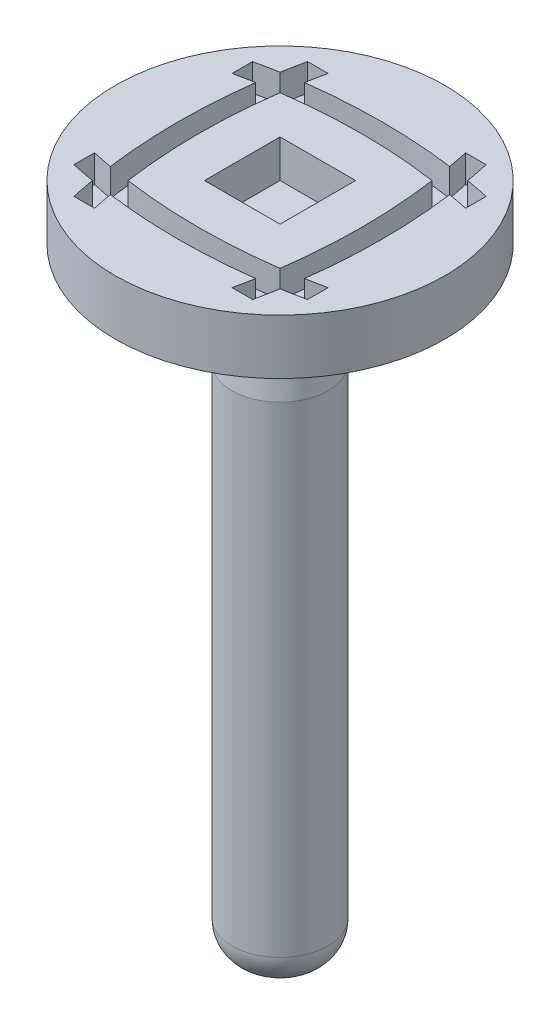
ISO-10303-21;
HEADER;
FILE_DESCRIPTION(('STEP AP214'),'2;1');
FILE_NAME('part.step','',(''),(''),'','','');
FILE_SCHEMA(('AUTOMOTIVE_DESIGN { 1 0 10303 214 1 1 1 1 }'));
ENDSEC;
DATA;
#1=APPLICATION_CONTEXT('core data for automotive mechanical design processes');
#2=APPLICATION_PROTOCOL_DEFINITION('international standard','automotive_design',2000,#1);
#3=PRODUCT_CONTEXT('',#1,'mechanical');
#4=PRODUCT('Part','Part','',(#3));
#5=PRODUCT_RELATED_PRODUCT_CATEGORY('part','',(#4));
#6=PRODUCT_DEFINITION_FORMATION('','',#4);
#7=PRODUCT_DEFINITION_CONTEXT('part definition',#1,'design');
#8=PRODUCT_DEFINITION('design','',#6,#7);
#9=PRODUCT_DEFINITION_SHAPE('','',#8);
#10=(LENGTH_UNIT() NAMED_UNIT(*) SI_UNIT(.MILLI.,.METRE.));
#11=(NAMED_UNIT(*) PLANE_ANGLE_UNIT() SI_UNIT($,.RADIAN.));
#12=(NAMED_UNIT(*) SI_UNIT($,.STERADIAN.) SOLID_ANGLE_UNIT());
#13=UNCERTAINTY_MEASURE_WITH_UNIT(LENGTH_MEASURE(1.E-05),#10,'distance_accuracy_value','');
#14=(GEOMETRIC_REPRESENTATION_CONTEXT(3) GLOBAL_UNCERTAINTY_ASSIGNED_CONTEXT((#13)) GLOBAL_UNIT_ASSIGNED_CONTEXT((#10,
#11,#12)) REPRESENTATION_CONTEXT('',''));
#15=CARTESIAN_POINT('',(0.,0.,0.));
#16=DIRECTION('',(0.,0.,1.));
#17=DIRECTION('',(1.,0.,0.));
#18=AXIS2_PLACEMENT_3D('',#15,#16,#17);
#19=CARTESIAN_POINT('',(0.,8.,0.));
#20=DIRECTION('',(0.,-1.,0.));
#21=DIRECTION('',(0.,0.,-1.));
#22=AXIS2_PLACEMENT_3D('',#19,#20,#21);
#23=CYLINDRICAL_SURFACE('',#22,24.);
#24=CARTESIAN_POINT('',(0.,8.,0.));
#25=DIRECTION('',(0.,1.,0.));
#26=DIRECTION('',(0.,0.,1.));
#27=AXIS2_PLACEMENT_3D('',#24,#25,#26);
#28=CIRCLE('',#27,24.);
#29=CARTESIAN_POINT('',(0.,8.,24.));
#30=VERTEX_POINT('',#29);
#31=EDGE_CURVE('E566',#30,#30,#28,.T.);
#32=ORIENTED_EDGE('',*,*,#31,.F.);
#33=EDGE_LOOP('',(#32));
#34=FACE_BOUND('',#33,.T.);
#35=CARTESIAN_POINT('',(0.,0.,0.));
#36=DIRECTION('',(0.,1.,0.));
#37=DIRECTION('',(0.,0.,1.));
#38=AXIS2_PLACEMENT_3D('',#35,#36,#37);
#39=CIRCLE('',#38,24.);
#40=CARTESIAN_POINT('',(0.,0.,24.));
#41=VERTEX_POINT('',#40);
#42=EDGE_CURVE('E559',#41,#41,#39,.T.);
#43=ORIENTED_EDGE('',*,*,#42,.T.);
#44=EDGE_LOOP('',(#43));
#45=FACE_BOUND('',#44,.T.);
#46=ADVANCED_FACE('F35',(#34,#45),#23,.T.);
#47=CARTESIAN_POINT('',(0.,8.,0.));
#48=DIRECTION('',(0.,1.,0.));
#49=DIRECTION('',(0.,0.,1.));
#50=AXIS2_PLACEMENT_3D('',#47,#48,#49);
#51=PLANE('',#50);
#52=CARTESIAN_POINT('',(0.,8.,65.1728853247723));
#53=DIRECTION('',(0.,1.,0.));
#54=DIRECTION('',(0.,0.,-1.));
#55=AXIS2_PLACEMENT_3D('',#52,#53,#54);
#56=CIRCLE('',#55,80.);
#57=CARTESIAN_POINT('',(-13.6534076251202,8.,-13.6534076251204));
#58=VERTEX_POINT('',#57);
#59=CARTESIAN_POINT('',(-17.,8.,-13.));
#60=VERTEX_POINT('',#59);
#61=EDGE_CURVE('E50',#58,#60,#56,.T.);
#62=ORIENTED_EDGE('',*,*,#61,.F.);
#63=CARTESIAN_POINT('',(65.1728853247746,8.,-3.61937451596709E-12));
#64=DIRECTION('',(0.,1.,0.));
#65=DIRECTION('',(0.,0.,-1.));
#66=AXIS2_PLACEMENT_3D('',#63,#64,#65);
#67=CIRCLE('',#66,80.0000000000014);
#68=CARTESIAN_POINT('',(-12.9999999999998,8.,-17.0000000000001));
#69=VERTEX_POINT('',#68);
#70=EDGE_CURVE('E315',#69,#58,#67,.T.);
#71=ORIENTED_EDGE('',*,*,#70,.F.);
#72=DIRECTION('',(-1.,0.,2.15105711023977E-13));
#73=VECTOR('',#72,1.);
#74=CARTESIAN_POINT('',(-10.0000000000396,8.,-17.0000000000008));
#75=LINE('',#74,#73);
#76=CARTESIAN_POINT('',(-10.0000000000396,8.,-17.0000000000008));
#77=VERTEX_POINT('',#76);
#78=EDGE_CURVE('E473',#77,#69,#75,.T.);
#79=ORIENTED_EDGE('',*,*,#78,.F.);
#80=CARTESIAN_POINT('',(67.4053186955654,8.,-9.76183332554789E-11));
#81=DIRECTION('',(0.,-1.,0.));
#82=DIRECTION('',(0.,0.,-1.));
#83=AXIS2_PLACEMENT_3D('',#80,#81,#82);
#84=CIRCLE('',#83,79.2501316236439);
#85=CARTESIAN_POINT('',(-10.5758870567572,8.,-14.1249747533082));
#86=VERTEX_POINT('',#85);
#87=EDGE_CURVE('E470',#86,#77,#84,.T.);
#88=ORIENTED_EDGE('',*,*,#87,.F.);
#89=CARTESIAN_POINT('',(0.,8.,65.1728853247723));
#90=DIRECTION('',(0.,1.,0.));
#91=DIRECTION('',(0.,0.,-1.));
#92=AXIS2_PLACEMENT_3D('',#89,#90,#91);
#93=CIRCLE('',#92,80.0000000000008);
#94=CARTESIAN_POINT('',(10.5758870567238,8.,-14.1249747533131));
#95=VERTEX_POINT('',#94);
#96=EDGE_CURVE('E467',#95,#86,#93,.T.);
#97=ORIENTED_EDGE('',*,*,#96,.F.);
#98=CARTESIAN_POINT('',(-67.4053186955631,8.,9.37728701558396E-11));
#99=DIRECTION('',(0.,-1.,0.));
#100=DIRECTION('',(0.,0.,-1.));
#101=AXIS2_PLACEMENT_3D('',#98,#99,#100);
#102=CIRCLE('',#101,79.2501316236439);
#103=CARTESIAN_POINT('',(10.0000000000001,8.,-17.));
#104=VERTEX_POINT('',#103);
#105=EDGE_CURVE('E464',#104,#95,#102,.T.);
#106=ORIENTED_EDGE('',*,*,#105,.F.);
#107=DIRECTION('',(-1.,0.,0.));
#108=VECTOR('',#107,1.);
#109=CARTESIAN_POINT('',(13.0000000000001,8.,-17.));
#110=LINE('',#109,#108);
#111=CARTESIAN_POINT('',(13.0000000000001,8.,-17.));
#112=VERTEX_POINT('',#111);
#113=EDGE_CURVE('E461',#112,#104,#110,.T.);
#114=ORIENTED_EDGE('',*,*,#113,.F.);
#115=CARTESIAN_POINT('',(-65.1728853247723,8.,-2.25815189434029E-13));
#116=DIRECTION('',(0.,1.,0.));
#117=DIRECTION('',(0.,0.,-1.));
#118=AXIS2_PLACEMENT_3D('',#115,#116,#117);
#119=CIRCLE('',#118,80.);
#120=CARTESIAN_POINT('',(13.6534076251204,8.,-13.6534076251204));
#121=VERTEX_POINT('',#120);
#122=EDGE_CURVE('E458',#121,#112,#119,.T.);
#123=ORIENTED_EDGE('',*,*,#122,.F.);
#124=CARTESIAN_POINT('',(0.,8.,65.1728853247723));
#125=DIRECTION('',(0.,1.,0.));
#126=DIRECTION('',(0.,0.,-1.));
#127=AXIS2_PLACEMENT_3D('',#124,#125,#126);
#128=CIRCLE('',#127,80.);
#129=CARTESIAN_POINT('',(17.,8.,-13.));
#130=VERTEX_POINT('',#129);
#131=EDGE_CURVE('E455',#130,#121,#128,.T.);
#132=ORIENTED_EDGE('',*,*,#131,.F.);
#133=DIRECTION('',(0.,0.,-1.));
#134=VECTOR('',#133,1.);
#135=CARTESIAN_POINT('',(17.,8.,-10.0000000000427));
#136=LINE('',#135,#134);
#137=CARTESIAN_POINT('',(17.,8.,-10.0000000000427));
#138=VERTEX_POINT('',#137);
#139=EDGE_CURVE('E452',#138,#130,#136,.T.);
#140=ORIENTED_EDGE('',*,*,#139,.F.);
#141=CARTESIAN_POINT('',(9.68253255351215E-11,8.,67.4053186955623));
#142=DIRECTION('',(0.,-1.,0.));
#143=DIRECTION('',(0.,0.,-1.));
#144=AXIS2_PLACEMENT_3D('',#141,#142,#143);
#145=CIRCLE('',#144,79.2501316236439);
#146=CARTESIAN_POINT('',(14.1249747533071,8.,-10.5758870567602));
#147=VERTEX_POINT('',#146);
#148=EDGE_CURVE('E449',#147,#138,#145,.T.);
#149=ORIENTED_EDGE('',*,*,#148,.F.);
#150=CARTESIAN_POINT('',(-65.1728853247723,8.,-2.25815189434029E-13));
#151=DIRECTION('',(0.,1.,0.));
#152=DIRECTION('',(0.,0.,-1.));
#153=AXIS2_PLACEMENT_3D('',#150,#151,#152);
#154=CIRCLE('',#153,80.);
#155=CARTESIAN_POINT('',(14.1249747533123,8.,10.5758870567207));
#156=VERTEX_POINT('',#155);
#157=EDGE_CURVE('E446',#156,#147,#154,.T.);
#158=ORIENTED_EDGE('',*,*,#157,.F.);
#159=CARTESIAN_POINT('',(-9.45576231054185E-11,8.,-67.4053186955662));
#160=DIRECTION('',(0.,-1.,0.));
#161=DIRECTION('',(0.,0.,-1.));
#162=AXIS2_PLACEMENT_3D('',#159,#160,#161);
#163=CIRCLE('',#162,79.2501316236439);
#164=CARTESIAN_POINT('',(17.0000000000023,8.,9.99999999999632));
#165=VERTEX_POINT('',#164);
#166=EDGE_CURVE('E443',#165,#156,#163,.T.);
#167=ORIENTED_EDGE('',*,*,#166,.F.);
#168=DIRECTION('',(0.,0.,-1.));
#169=VECTOR('',#168,1.);
#170=CARTESIAN_POINT('',(17.0000000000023,8.,12.9999999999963));
#171=LINE('',#170,#169);
#172=CARTESIAN_POINT('',(17.0000000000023,8.,12.9999999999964));
#173=VERTEX_POINT('',#172);
#174=EDGE_CURVE('E440',#173,#165,#171,.T.);
#175=ORIENTED_EDGE('',*,*,#174,.F.);
#176=CARTESIAN_POINT('',(4.53365102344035E-13,8.,-65.1728853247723));
#177=DIRECTION('',(0.,1.,0.));
#178=DIRECTION('',(0.,0.,-1.));
#179=AXIS2_PLACEMENT_3D('',#176,#177,#178);
#180=CIRCLE('',#179,79.9999999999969);
#181=CARTESIAN_POINT('',(13.6534076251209,8.,13.6534076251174));
#182=VERTEX_POINT('',#181);
#183=EDGE_CURVE('E437',#182,#173,#180,.T.);
#184=ORIENTED_EDGE('',*,*,#183,.F.);
#185=CARTESIAN_POINT('',(-65.1728853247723,8.,-2.25815189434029E-13));
#186=DIRECTION('',(0.,1.,0.));
#187=DIRECTION('',(0.,0.,-1.));
#188=AXIS2_PLACEMENT_3D('',#185,#186,#187);
#189=CIRCLE('',#188,80.);
#190=CARTESIAN_POINT('',(12.9999999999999,8.,17.));
#191=VERTEX_POINT('',#190);
#192=EDGE_CURVE('E434',#191,#182,#189,.T.);
#193=ORIENTED_EDGE('',*,*,#192,.F.);
#194=DIRECTION('',(1.,0.,1.0327387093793E-12));
#195=VECTOR('',#194,1.);
#196=CARTESIAN_POINT('',(10.0000000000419,8.,16.9999999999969));
#197=LINE('',#196,#195);
#198=CARTESIAN_POINT('',(10.0000000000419,8.,16.999999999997));
#199=VERTEX_POINT('',#198);
#200=EDGE_CURVE('E431',#199,#191,#197,.T.);
#201=ORIENTED_EDGE('',*,*,#200,.F.);
#202=CARTESIAN_POINT('',(-67.4053186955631,8.,9.37728701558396E-11));
#203=DIRECTION('',(0.,-1.,0.));
#204=DIRECTION('',(0.,0.,-1.));
#205=AXIS2_PLACEMENT_3D('',#202,#203,#204);
#206=CIRCLE('',#205,79.2501316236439);
#207=CARTESIAN_POINT('',(10.5758870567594,8.,14.1249747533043));
#208=VERTEX_POINT('',#207);
#209=EDGE_CURVE('E428',#208,#199,#206,.T.);
#210=ORIENTED_EDGE('',*,*,#209,.F.);
#211=CARTESIAN_POINT('',(4.53365102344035E-13,8.,-65.1728853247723));
#212=DIRECTION('',(0.,1.,0.));
#213=DIRECTION('',(0.,0.,-1.));
#214=AXIS2_PLACEMENT_3D('',#211,#212,#213);
#215=CIRCLE('',#214,79.9999999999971);
#216=CARTESIAN_POINT('',(-10.575887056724,8.,14.1249747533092));
#217=VERTEX_POINT('',#216);
#218=EDGE_CURVE('E425',#217,#208,#215,.T.);
#219=ORIENTED_EDGE('',*,*,#218,.F.);
#220=CARTESIAN_POINT('',(67.4053186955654,8.,-9.76183332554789E-11));
#221=DIRECTION('',(0.,-1.,0.));
#222=DIRECTION('',(0.,0.,-1.));
#223=AXIS2_PLACEMENT_3D('',#220,#221,#222);
#224=CIRCLE('',#223,79.2501316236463);
#225=CARTESIAN_POINT('',(-10.0000000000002,8.,16.9999999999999));
#226=VERTEX_POINT('',#225);
#227=EDGE_CURVE('E422',#226,#217,#224,.T.);
#228=ORIENTED_EDGE('',*,*,#227,.F.);
#229=DIRECTION('',(1.,0.,0.));
#230=VECTOR('',#229,1.);
#231=CARTESIAN_POINT('',(-13.0000000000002,8.,16.9999999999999));
#232=LINE('',#231,#230);
#233=CARTESIAN_POINT('',(-12.9999999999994,8.,16.9999999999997));
#234=VERTEX_POINT('',#233);
#235=EDGE_CURVE('E419',#234,#226,#232,.T.);
#236=ORIENTED_EDGE('',*,*,#235,.F.);
#237=CARTESIAN_POINT('',(65.1728853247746,8.,-3.61937451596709E-12));
#238=DIRECTION('',(0.,1.,0.));
#239=DIRECTION('',(0.,0.,-1.));
#240=AXIS2_PLACEMENT_3D('',#237,#238,#239);
#241=CIRCLE('',#240,80.0000000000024);
#242=CARTESIAN_POINT('',(-13.6534076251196,8.,13.6534076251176));
#243=VERTEX_POINT('',#242);
#244=EDGE_CURVE('E416',#243,#234,#241,.T.);
#245=ORIENTED_EDGE('',*,*,#244,.F.);
#246=CARTESIAN_POINT('',(4.53365102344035E-13,8.,-65.1728853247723));
#247=DIRECTION('',(0.,1.,0.));
#248=DIRECTION('',(0.,0.,-1.));
#249=AXIS2_PLACEMENT_3D('',#246,#247,#248);
#250=CIRCLE('',#249,79.9999999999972);
#251=CARTESIAN_POINT('',(-16.9999999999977,8.,12.9999999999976));
#252=VERTEX_POINT('',#251);
#253=EDGE_CURVE('E413',#252,#243,#250,.T.);
#254=ORIENTED_EDGE('',*,*,#253,.F.);
#255=DIRECTION('',(0.,0.,1.));
#256=VECTOR('',#255,1.);
#257=CARTESIAN_POINT('',(-16.9999999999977,8.,10.0000000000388));
#258=LINE('',#257,#256);
#259=CARTESIAN_POINT('',(-16.9999999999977,8.,10.0000000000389));
#260=VERTEX_POINT('',#259);
#261=EDGE_CURVE('E410',#260,#252,#258,.T.);
#262=ORIENTED_EDGE('',*,*,#261,.F.);
#263=CARTESIAN_POINT('',(-9.45576231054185E-11,8.,-67.4053186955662));
#264=DIRECTION('',(0.,-1.,0.));
#265=DIRECTION('',(0.,0.,-1.));
#266=AXIS2_PLACEMENT_3D('',#263,#264,#265);
#267=CIRCLE('',#266,79.2501316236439);
#268=CARTESIAN_POINT('',(-14.1249747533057,8.,10.575887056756));
#269=VERTEX_POINT('',#268);
#270=EDGE_CURVE('E407',#269,#260,#267,.T.);
#271=ORIENTED_EDGE('',*,*,#270,.F.);
#272=CARTESIAN_POINT('',(65.1728853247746,8.,-3.61937451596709E-12));
#273=DIRECTION('',(0.,1.,0.));
#274=DIRECTION('',(0.,0.,-1.));
#275=AXIS2_PLACEMENT_3D('',#272,#273,#274);
#276=CIRCLE('',#275,80.0000000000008);
#277=CARTESIAN_POINT('',(-14.12497475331,8.,-10.5758870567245));
#278=VERTEX_POINT('',#277);
#279=EDGE_CURVE('E404',#278,#269,#276,.T.);
#280=ORIENTED_EDGE('',*,*,#279,.F.);
#281=CARTESIAN_POINT('',(9.68253255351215E-11,8.,67.4053186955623));
#282=DIRECTION('',(0.,-1.,0.));
#283=DIRECTION('',(0.,0.,-1.));
#284=AXIS2_PLACEMENT_3D('',#281,#282,#283);
#285=CIRCLE('',#284,79.2501316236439);
#286=CARTESIAN_POINT('',(-17.,8.,-10.));
#287=VERTEX_POINT('',#286);
#288=EDGE_CURVE('E401',#287,#278,#285,.T.);
#289=ORIENTED_EDGE('',*,*,#288,.F.);
#290=DIRECTION('',(0.,0.,1.));
#291=VECTOR('',#290,1.);
#292=CARTESIAN_POINT('',(-17.,8.,-13.));
#293=LINE('',#292,#291);
#294=EDGE_CURVE('E398',#60,#287,#293,.T.);
#295=ORIENTED_EDGE('',*,*,#294,.F.);
#296=EDGE_LOOP('',(#62,#71,#79,#88,#97,#106,#114,#123,#132,#140,#149,#158,#167,#175,#184,#193,
#201,#210,#219,#228,#236,#245,#254,#262,#271,#280,#289,#295));
#297=FACE_BOUND('',#296,.T.);
#298=ORIENTED_EDGE('',*,*,#31,.T.);
#299=EDGE_LOOP('',(#298));
#300=FACE_BOUND('',#299,.T.);
#301=ADVANCED_FACE('F589',(#297,#300),#51,.T.);
#302=CARTESIAN_POINT('',(0.,0.,0.));
#303=DIRECTION('',(0.,1.,0.));
#304=DIRECTION('',(0.,0.,1.));
#305=AXIS2_PLACEMENT_3D('',#302,#303,#304);
#306=PLANE('',#305);
#307=CARTESIAN_POINT('',(0.,0.,0.));
#308=DIRECTION('',(0.,1.,0.));
#309=DIRECTION('',(0.,0.,1.));
#310=AXIS2_PLACEMENT_3D('',#307,#308,#309);
#311=CIRCLE('',#310,5.);
#312=CARTESIAN_POINT('',(0.,0.,5.));
#313=VERTEX_POINT('',#312);
#314=EDGE_CURVE('E569',#313,#313,#311,.F.);
#315=ORIENTED_EDGE('',*,*,#314,.F.);
#316=EDGE_LOOP('',(#315));
#317=FACE_BOUND('',#316,.T.);
#318=ORIENTED_EDGE('',*,*,#42,.F.);
#319=EDGE_LOOP('',(#318));
#320=FACE_BOUND('',#319,.T.);
#321=ADVANCED_FACE('F594',(#317,#320),#306,.F.);
#322=CARTESIAN_POINT('',(0.,4.,65.1728853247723));
#323=DIRECTION('',(0.,1.,0.));
#324=DIRECTION('',(0.,0.,1.));
#325=AXIS2_PLACEMENT_3D('',#322,#323,#324);
#326=CYLINDRICAL_SURFACE('',#325,80.);
#327=ORIENTED_EDGE('',*,*,#61,.T.);
#328=DIRECTION('',(0.,1.,0.));
#329=VECTOR('',#328,1.);
#330=CARTESIAN_POINT('',(-17.,4.,-13.));
#331=LINE('',#330,#329);
#332=CARTESIAN_POINT('',(-17.,4.,-13.));
#333=VERTEX_POINT('',#332);
#334=EDGE_CURVE('E396',#333,#60,#331,.T.);
#335=ORIENTED_EDGE('',*,*,#334,.F.);
#336=CARTESIAN_POINT('',(0.,4.,65.1728853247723));
#337=DIRECTION('',(0.,1.,0.));
#338=DIRECTION('',(0.,0.,-1.));
#339=AXIS2_PLACEMENT_3D('',#336,#337,#338);
#340=CIRCLE('',#339,80.);
#341=CARTESIAN_POINT('',(-13.6534076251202,4.,-13.6534076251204));
#342=VERTEX_POINT('',#341);
#343=EDGE_CURVE('E311',#342,#333,#340,.T.);
#344=ORIENTED_EDGE('',*,*,#343,.F.);
#345=DIRECTION('',(0.,1.,0.));
#346=VECTOR('',#345,1.);
#347=CARTESIAN_POINT('',(-13.6534076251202,4.,-13.6534076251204));
#348=LINE('',#347,#346);
#349=EDGE_CURVE('E478',#342,#58,#348,.T.);
#350=ORIENTED_EDGE('',*,*,#349,.T.);
#351=EDGE_LOOP('',(#327,#335,#344,#350));
#352=FACE_BOUND('',#351,.T.);
#353=ADVANCED_FACE('F602',(#352),#326,.F.);
#354=CARTESIAN_POINT('',(65.1728853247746,4.,-3.61937451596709E-12));
#355=DIRECTION('',(0.,1.,0.));
#356=DIRECTION('',(0.,0.,1.));
#357=AXIS2_PLACEMENT_3D('',#354,#355,#356);
#358=CYLINDRICAL_SURFACE('',#357,80.0000000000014);
#359=ORIENTED_EDGE('',*,*,#70,.T.);
#360=ORIENTED_EDGE('',*,*,#349,.F.);
#361=CARTESIAN_POINT('',(65.1728853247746,4.,-3.61937451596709E-12));
#362=DIRECTION('',(0.,1.,0.));
#363=DIRECTION('',(0.,0.,-1.));
#364=AXIS2_PLACEMENT_3D('',#361,#362,#363);
#365=CIRCLE('',#364,80.0000000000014);
#366=CARTESIAN_POINT('',(-12.9999999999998,4.,-17.0000000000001));
#367=VERTEX_POINT('',#366);
#368=EDGE_CURVE('E393',#367,#342,#365,.T.);
#369=ORIENTED_EDGE('',*,*,#368,.F.);
#370=DIRECTION('',(0.,1.,0.));
#371=VECTOR('',#370,1.);
#372=CARTESIAN_POINT('',(-12.9999999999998,4.,-17.0000000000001));
#373=LINE('',#372,#371);
#374=EDGE_CURVE('E481',#367,#69,#373,.T.);
#375=ORIENTED_EDGE('',*,*,#374,.T.);
#376=EDGE_LOOP('',(#359,#360,#369,#375));
#377=FACE_BOUND('',#376,.T.);
#378=ADVANCED_FACE('F627',(#377),#358,.F.);
#379=CARTESIAN_POINT('',(-10.0000000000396,4.,-17.0000000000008));
#380=DIRECTION('',(-2.15105711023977E-13,0.,-1.));
#381=DIRECTION('',(-1.,0.,2.15105711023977E-13));
#382=AXIS2_PLACEMENT_3D('',#379,#380,#381);
#383=PLANE('',#382);
#384=ORIENTED_EDGE('',*,*,#78,.T.);
#385=ORIENTED_EDGE('',*,*,#374,.F.);
#386=DIRECTION('',(-1.,0.,2.15105711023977E-13));
#387=VECTOR('',#386,1.);
#388=CARTESIAN_POINT('',(-10.0000000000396,4.,-17.0000000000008));
#389=LINE('',#388,#387);
#390=CARTESIAN_POINT('',(-10.0000000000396,4.,-17.0000000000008));
#391=VERTEX_POINT('',#390);
#392=EDGE_CURVE('E390',#391,#367,#389,.T.);
#393=ORIENTED_EDGE('',*,*,#392,.F.);
#394=DIRECTION('',(0.,1.,0.));
#395=VECTOR('',#394,1.);
#396=CARTESIAN_POINT('',(-10.0000000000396,4.,-17.0000000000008));
#397=LINE('',#396,#395);
#398=EDGE_CURVE('E483',#391,#77,#397,.T.);
#399=ORIENTED_EDGE('',*,*,#398,.T.);
#400=EDGE_LOOP('',(#384,#385,#393,#399));
#401=FACE_BOUND('',#400,.T.);
#402=ADVANCED_FACE('F727',(#401),#383,.F.);
#403=CARTESIAN_POINT('',(67.4053186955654,4.,-9.76183332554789E-11));
#404=DIRECTION('',(0.,1.,0.));
#405=DIRECTION('',(0.,0.,1.));
#406=AXIS2_PLACEMENT_3D('',#403,#404,#405);
#407=CYLINDRICAL_SURFACE('',#406,79.2501316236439);
#408=ORIENTED_EDGE('',*,*,#87,.T.);
#409=ORIENTED_EDGE('',*,*,#398,.F.);
#410=CARTESIAN_POINT('',(67.4053186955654,4.,-9.76183332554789E-11));
#411=DIRECTION('',(0.,-1.,0.));
#412=DIRECTION('',(0.,0.,-1.));
#413=AXIS2_PLACEMENT_3D('',#410,#411,#412);
#414=CIRCLE('',#413,79.2501316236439);
#415=CARTESIAN_POINT('',(-10.5758870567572,4.,-14.1249747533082));
#416=VERTEX_POINT('',#415);
#417=EDGE_CURVE('E387',#416,#391,#414,.T.);
#418=ORIENTED_EDGE('',*,*,#417,.F.);
#419=DIRECTION('',(0.,1.,0.));
#420=VECTOR('',#419,1.);
#421=CARTESIAN_POINT('',(-10.5758870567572,4.,-14.1249747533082));
#422=LINE('',#421,#420);
#423=EDGE_CURVE('E485',#416,#86,#422,.T.);
#424=ORIENTED_EDGE('',*,*,#423,.T.);
#425=EDGE_LOOP('',(#408,#409,#418,#424));
#426=FACE_BOUND('',#425,.T.);
#427=ADVANCED_FACE('F723',(#426),#407,.T.);
#428=CARTESIAN_POINT('',(0.,4.,65.1728853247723));
#429=DIRECTION('',(0.,1.,0.));
#430=DIRECTION('',(0.,0.,1.));
#431=AXIS2_PLACEMENT_3D('',#428,#429,#430);
#432=CYLINDRICAL_SURFACE('',#431,80.0000000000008);
#433=ORIENTED_EDGE('',*,*,#96,.T.);
#434=ORIENTED_EDGE('',*,*,#423,.F.);
#435=CARTESIAN_POINT('',(0.,4.,65.1728853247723));
#436=DIRECTION('',(0.,1.,0.));
#437=DIRECTION('',(0.,0.,-1.));
#438=AXIS2_PLACEMENT_3D('',#435,#436,#437);
#439=CIRCLE('',#438,80.0000000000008);
#440=CARTESIAN_POINT('',(10.5758870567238,4.,-14.1249747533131));
#441=VERTEX_POINT('',#440);
#442=EDGE_CURVE('E384',#441,#416,#439,.T.);
#443=ORIENTED_EDGE('',*,*,#442,.F.);
#444=DIRECTION('',(0.,1.,0.));
#445=VECTOR('',#444,1.);
#446=CARTESIAN_POINT('',(10.5758870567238,4.,-14.1249747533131));
#447=LINE('',#446,#445);
#448=EDGE_CURVE('E487',#441,#95,#447,.T.);
#449=ORIENTED_EDGE('',*,*,#448,.T.);
#450=EDGE_LOOP('',(#433,#434,#443,#449));
#451=FACE_BOUND('',#450,.T.);
#452=ADVANCED_FACE('F719',(#451),#432,.F.);
#453=CARTESIAN_POINT('',(-67.4053186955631,4.,9.37728701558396E-11));
#454=DIRECTION('',(0.,1.,0.));
#455=DIRECTION('',(0.,0.,1.));
#456=AXIS2_PLACEMENT_3D('',#453,#454,#455);
#457=CYLINDRICAL_SURFACE('',#456,79.2501316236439);
#458=ORIENTED_EDGE('',*,*,#105,.T.);
#459=ORIENTED_EDGE('',*,*,#448,.F.);
#460=CARTESIAN_POINT('',(-67.4053186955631,4.,9.37728701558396E-11));
#461=DIRECTION('',(0.,-1.,0.));
#462=DIRECTION('',(0.,0.,-1.));
#463=AXIS2_PLACEMENT_3D('',#460,#461,#462);
#464=CIRCLE('',#463,79.2501316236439);
#465=CARTESIAN_POINT('',(10.0000000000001,4.,-17.));
#466=VERTEX_POINT('',#465);
#467=EDGE_CURVE('E381',#466,#441,#464,.T.);
#468=ORIENTED_EDGE('',*,*,#467,.F.);
#469=DIRECTION('',(0.,1.,0.));
#470=VECTOR('',#469,1.);
#471=CARTESIAN_POINT('',(10.0000000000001,4.,-17.));
#472=LINE('',#471,#470);
#473=EDGE_CURVE('E489',#466,#104,#472,.T.);
#474=ORIENTED_EDGE('',*,*,#473,.T.);
#475=EDGE_LOOP('',(#458,#459,#468,#474));
#476=FACE_BOUND('',#475,.T.);
#477=ADVANCED_FACE('F715',(#476),#457,.T.);
#478=CARTESIAN_POINT('',(13.0000000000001,4.,-17.));
#479=DIRECTION('',(0.,0.,-1.));
#480=DIRECTION('',(-1.,0.,0.));
#481=AXIS2_PLACEMENT_3D('',#478,#479,#480);
#482=PLANE('',#481);
#483=ORIENTED_EDGE('',*,*,#113,.T.);
#484=ORIENTED_EDGE('',*,*,#473,.F.);
#485=DIRECTION('',(-1.,0.,0.));
#486=VECTOR('',#485,1.);
#487=CARTESIAN_POINT('',(13.0000000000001,4.,-17.));
#488=LINE('',#487,#486);
#489=CARTESIAN_POINT('',(13.0000000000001,4.,-17.));
#490=VERTEX_POINT('',#489);
#491=EDGE_CURVE('E378',#490,#466,#488,.T.);
#492=ORIENTED_EDGE('',*,*,#491,.F.);
#493=DIRECTION('',(0.,1.,0.));
#494=VECTOR('',#493,1.);
#495=CARTESIAN_POINT('',(13.0000000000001,4.,-17.));
#496=LINE('',#495,#494);
#497=EDGE_CURVE('E491',#490,#112,#496,.T.);
#498=ORIENTED_EDGE('',*,*,#497,.T.);
#499=EDGE_LOOP('',(#483,#484,#492,#498));
#500=FACE_BOUND('',#499,.T.);
#501=ADVANCED_FACE('F711',(#500),#482,.F.);
#502=CARTESIAN_POINT('',(-65.1728853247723,4.,-2.25815189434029E-13));
#503=DIRECTION('',(0.,1.,0.));
#504=DIRECTION('',(0.,0.,1.));
#505=AXIS2_PLACEMENT_3D('',#502,#503,#504);
#506=CYLINDRICAL_SURFACE('',#505,80.);
#507=ORIENTED_EDGE('',*,*,#122,.T.);
#508=ORIENTED_EDGE('',*,*,#497,.F.);
#509=CARTESIAN_POINT('',(-65.1728853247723,4.,-2.25815189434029E-13));
#510=DIRECTION('',(0.,1.,0.));
#511=DIRECTION('',(0.,0.,-1.));
#512=AXIS2_PLACEMENT_3D('',#509,#510,#511);
#513=CIRCLE('',#512,80.);
#514=CARTESIAN_POINT('',(13.6534076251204,4.,-13.6534076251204));
#515=VERTEX_POINT('',#514);
#516=EDGE_CURVE('E375',#515,#490,#513,.T.);
#517=ORIENTED_EDGE('',*,*,#516,.F.);
#518=DIRECTION('',(0.,1.,0.));
#519=VECTOR('',#518,1.);
#520=CARTESIAN_POINT('',(13.6534076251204,4.,-13.6534076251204));
#521=LINE('',#520,#519);
#522=EDGE_CURVE('E493',#515,#121,#521,.T.);
#523=ORIENTED_EDGE('',*,*,#522,.T.);
#524=EDGE_LOOP('',(#507,#508,#517,#523));
#525=FACE_BOUND('',#524,.T.);
#526=ADVANCED_FACE('F707',(#525),#506,.F.);
#527=CARTESIAN_POINT('',(0.,4.,65.1728853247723));
#528=DIRECTION('',(0.,1.,0.));
#529=DIRECTION('',(0.,0.,1.));
#530=AXIS2_PLACEMENT_3D('',#527,#528,#529);
#531=CYLINDRICAL_SURFACE('',#530,80.);
#532=ORIENTED_EDGE('',*,*,#131,.T.);
#533=ORIENTED_EDGE('',*,*,#522,.F.);
#534=CARTESIAN_POINT('',(0.,4.,65.1728853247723));
#535=DIRECTION('',(0.,1.,0.));
#536=DIRECTION('',(0.,0.,-1.));
#537=AXIS2_PLACEMENT_3D('',#534,#535,#536);
#538=CIRCLE('',#537,80.);
#539=CARTESIAN_POINT('',(17.,4.,-13.));
#540=VERTEX_POINT('',#539);
#541=EDGE_CURVE('E372',#540,#515,#538,.T.);
#542=ORIENTED_EDGE('',*,*,#541,.F.);
#543=DIRECTION('',(0.,1.,0.));
#544=VECTOR('',#543,1.);
#545=CARTESIAN_POINT('',(17.,4.,-13.));
#546=LINE('',#545,#544);
#547=EDGE_CURVE('E495',#540,#130,#546,.T.);
#548=ORIENTED_EDGE('',*,*,#547,.T.);
#549=EDGE_LOOP('',(#532,#533,#542,#548));
#550=FACE_BOUND('',#549,.T.);
#551=ADVANCED_FACE('F703',(#550),#531,.F.);
#552=CARTESIAN_POINT('',(17.,4.,-10.0000000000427));
#553=DIRECTION('',(1.,0.,0.));
#554=DIRECTION('',(0.,0.,-1.));
#555=AXIS2_PLACEMENT_3D('',#552,#553,#554);
#556=PLANE('',#555);
#557=ORIENTED_EDGE('',*,*,#139,.T.);
#558=ORIENTED_EDGE('',*,*,#547,.F.);
#559=DIRECTION('',(0.,0.,-1.));
#560=VECTOR('',#559,1.);
#561=CARTESIAN_POINT('',(17.,4.,-10.0000000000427));
#562=LINE('',#561,#560);
#563=CARTESIAN_POINT('',(17.,4.,-10.0000000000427));
#564=VERTEX_POINT('',#563);
#565=EDGE_CURVE('E369',#564,#540,#562,.T.);
#566=ORIENTED_EDGE('',*,*,#565,.F.);
#567=DIRECTION('',(0.,1.,0.));
#568=VECTOR('',#567,1.);
#569=CARTESIAN_POINT('',(17.,4.,-10.0000000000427));
#570=LINE('',#569,#568);
#571=EDGE_CURVE('E497',#564,#138,#570,.T.);
#572=ORIENTED_EDGE('',*,*,#571,.T.);
#573=EDGE_LOOP('',(#557,#558,#566,#572));
#574=FACE_BOUND('',#573,.T.);
#575=ADVANCED_FACE('F699',(#574),#556,.F.);
#576=CARTESIAN_POINT('',(9.68253255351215E-11,4.,67.4053186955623));
#577=DIRECTION('',(0.,1.,0.));
#578=DIRECTION('',(0.,0.,1.));
#579=AXIS2_PLACEMENT_3D('',#576,#577,#578);
#580=CYLINDRICAL_SURFACE('',#579,79.2501316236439);
#581=ORIENTED_EDGE('',*,*,#148,.T.);
#582=ORIENTED_EDGE('',*,*,#571,.F.);
#583=CARTESIAN_POINT('',(9.68253255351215E-11,4.,67.4053186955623));
#584=DIRECTION('',(0.,-1.,0.));
#585=DIRECTION('',(0.,0.,-1.));
#586=AXIS2_PLACEMENT_3D('',#583,#584,#585);
#587=CIRCLE('',#586,79.2501316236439);
#588=CARTESIAN_POINT('',(14.1249747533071,4.,-10.5758870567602));
#589=VERTEX_POINT('',#588);
#590=EDGE_CURVE('E366',#589,#564,#587,.T.);
#591=ORIENTED_EDGE('',*,*,#590,.F.);
#592=DIRECTION('',(0.,1.,0.));
#593=VECTOR('',#592,1.);
#594=CARTESIAN_POINT('',(14.1249747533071,4.,-10.5758870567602));
#595=LINE('',#594,#593);
#596=EDGE_CURVE('E499',#589,#147,#595,.T.);
#597=ORIENTED_EDGE('',*,*,#596,.T.);
#598=EDGE_LOOP('',(#581,#582,#591,#597));
#599=FACE_BOUND('',#598,.T.);
#600=ADVANCED_FACE('F695',(#599),#580,.T.);
#601=CARTESIAN_POINT('',(-65.1728853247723,4.,-2.25815189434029E-13));
#602=DIRECTION('',(0.,1.,0.));
#603=DIRECTION('',(0.,0.,1.));
#604=AXIS2_PLACEMENT_3D('',#601,#602,#603);
#605=CYLINDRICAL_SURFACE('',#604,80.);
#606=ORIENTED_EDGE('',*,*,#157,.T.);
#607=ORIENTED_EDGE('',*,*,#596,.F.);
#608=CARTESIAN_POINT('',(-65.1728853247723,4.,-2.25815189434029E-13));
#609=DIRECTION('',(0.,1.,0.));
#610=DIRECTION('',(0.,0.,-1.));
#611=AXIS2_PLACEMENT_3D('',#608,#609,#610);
#612=CIRCLE('',#611,80.);
#613=CARTESIAN_POINT('',(14.1249747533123,4.,10.5758870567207));
#614=VERTEX_POINT('',#613);
#615=EDGE_CURVE('E363',#614,#589,#612,.T.);
#616=ORIENTED_EDGE('',*,*,#615,.F.);
#617=DIRECTION('',(0.,1.,0.));
#618=VECTOR('',#617,1.);
#619=CARTESIAN_POINT('',(14.1249747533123,4.,10.5758870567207));
#620=LINE('',#619,#618);
#621=EDGE_CURVE('E501',#614,#156,#620,.T.);
#622=ORIENTED_EDGE('',*,*,#621,.T.);
#623=EDGE_LOOP('',(#606,#607,#616,#622));
#624=FACE_BOUND('',#623,.T.);
#625=ADVANCED_FACE('F691',(#624),#605,.F.);
#626=CARTESIAN_POINT('',(-9.45576231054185E-11,4.,-67.4053186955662));
#627=DIRECTION('',(0.,1.,0.));
#628=DIRECTION('',(0.,0.,1.));
#629=AXIS2_PLACEMENT_3D('',#626,#627,#628);
#630=CYLINDRICAL_SURFACE('',#629,79.2501316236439);
#631=ORIENTED_EDGE('',*,*,#166,.T.);
#632=ORIENTED_EDGE('',*,*,#621,.F.);
#633=CARTESIAN_POINT('',(-9.45576231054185E-11,4.,-67.4053186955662));
#634=DIRECTION('',(0.,-1.,0.));
#635=DIRECTION('',(0.,0.,-1.));
#636=AXIS2_PLACEMENT_3D('',#633,#634,#635);
#637=CIRCLE('',#636,79.2501316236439);
#638=CARTESIAN_POINT('',(17.0000000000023,4.,9.99999999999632));
#639=VERTEX_POINT('',#638);
#640=EDGE_CURVE('E360',#639,#614,#637,.T.);
#641=ORIENTED_EDGE('',*,*,#640,.F.);
#642=DIRECTION('',(0.,1.,0.));
#643=VECTOR('',#642,1.);
#644=CARTESIAN_POINT('',(17.0000000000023,4.,9.99999999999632));
#645=LINE('',#644,#643);
#646=EDGE_CURVE('E503',#639,#165,#645,.T.);
#647=ORIENTED_EDGE('',*,*,#646,.T.);
#648=EDGE_LOOP('',(#631,#632,#641,#647));
#649=FACE_BOUND('',#648,.T.);
#650=ADVANCED_FACE('F687',(#649),#630,.T.);
#651=CARTESIAN_POINT('',(17.0000000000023,4.,12.9999999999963));
#652=DIRECTION('',(1.,0.,0.));
#653=DIRECTION('',(0.,0.,-1.));
#654=AXIS2_PLACEMENT_3D('',#651,#652,#653);
#655=PLANE('',#654);
#656=ORIENTED_EDGE('',*,*,#174,.T.);
#657=ORIENTED_EDGE('',*,*,#646,.F.);
#658=DIRECTION('',(0.,0.,-1.));
#659=VECTOR('',#658,1.);
#660=CARTESIAN_POINT('',(17.0000000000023,4.,12.9999999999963));
#661=LINE('',#660,#659);
#662=CARTESIAN_POINT('',(17.0000000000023,4.,12.9999999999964));
#663=VERTEX_POINT('',#662);
#664=EDGE_CURVE('E357',#663,#639,#661,.T.);
#665=ORIENTED_EDGE('',*,*,#664,.F.);
#666=DIRECTION('',(0.,1.,0.));
#667=VECTOR('',#666,1.);
#668=CARTESIAN_POINT('',(17.0000000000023,4.,12.9999999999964));
#669=LINE('',#668,#667);
#670=EDGE_CURVE('E505',#663,#173,#669,.T.);
#671=ORIENTED_EDGE('',*,*,#670,.T.);
#672=EDGE_LOOP('',(#656,#657,#665,#671));
#673=FACE_BOUND('',#672,.T.);
#674=ADVANCED_FACE('F683',(#673),#655,.F.);
#675=CARTESIAN_POINT('',(4.53365102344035E-13,4.,-65.1728853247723));
#676=DIRECTION('',(0.,1.,0.));
#677=DIRECTION('',(0.,0.,1.));
#678=AXIS2_PLACEMENT_3D('',#675,#676,#677);
#679=CYLINDRICAL_SURFACE('',#678,79.9999999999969);
#680=ORIENTED_EDGE('',*,*,#183,.T.);
#681=ORIENTED_EDGE('',*,*,#670,.F.);
#682=CARTESIAN_POINT('',(4.53365102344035E-13,4.,-65.1728853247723));
#683=DIRECTION('',(0.,1.,0.));
#684=DIRECTION('',(0.,0.,-1.));
#685=AXIS2_PLACEMENT_3D('',#682,#683,#684);
#686=CIRCLE('',#685,79.9999999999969);
#687=CARTESIAN_POINT('',(13.6534076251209,4.,13.6534076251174));
#688=VERTEX_POINT('',#687);
#689=EDGE_CURVE('E354',#688,#663,#686,.T.);
#690=ORIENTED_EDGE('',*,*,#689,.F.);
#691=DIRECTION('',(0.,1.,0.));
#692=VECTOR('',#691,1.);
#693=CARTESIAN_POINT('',(13.6534076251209,4.,13.6534076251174));
#694=LINE('',#693,#692);
#695=EDGE_CURVE('E507',#688,#182,#694,.T.);
#696=ORIENTED_EDGE('',*,*,#695,.T.);
#697=EDGE_LOOP('',(#680,#681,#690,#696));
#698=FACE_BOUND('',#697,.T.);
#699=ADVANCED_FACE('F679',(#698),#679,.F.);
#700=CARTESIAN_POINT('',(-65.1728853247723,4.,-2.25815189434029E-13));
#701=DIRECTION('',(0.,1.,0.));
#702=DIRECTION('',(0.,0.,1.));
#703=AXIS2_PLACEMENT_3D('',#700,#701,#702);
#704=CYLINDRICAL_SURFACE('',#703,80.);
#705=ORIENTED_EDGE('',*,*,#192,.T.);
#706=ORIENTED_EDGE('',*,*,#695,.F.);
#707=CARTESIAN_POINT('',(-65.1728853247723,4.,-2.25815189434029E-13));
#708=DIRECTION('',(0.,1.,0.));
#709=DIRECTION('',(0.,0.,-1.));
#710=AXIS2_PLACEMENT_3D('',#707,#708,#709);
#711=CIRCLE('',#710,80.);
#712=CARTESIAN_POINT('',(12.9999999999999,4.,17.));
#713=VERTEX_POINT('',#712);
#714=EDGE_CURVE('E351',#713,#688,#711,.T.);
#715=ORIENTED_EDGE('',*,*,#714,.F.);
#716=DIRECTION('',(0.,1.,0.));
#717=VECTOR('',#716,1.);
#718=CARTESIAN_POINT('',(12.9999999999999,4.,17.));
#719=LINE('',#718,#717);
#720=EDGE_CURVE('E509',#713,#191,#719,.T.);
#721=ORIENTED_EDGE('',*,*,#720,.T.);
#722=EDGE_LOOP('',(#705,#706,#715,#721));
#723=FACE_BOUND('',#722,.T.);
#724=ADVANCED_FACE('F675',(#723),#704,.F.);
#725=CARTESIAN_POINT('',(10.0000000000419,4.,16.9999999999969));
#726=DIRECTION('',(-1.0327387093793E-12,0.,1.));
#727=DIRECTION('',(1.,0.,1.0327387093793E-12));
#728=AXIS2_PLACEMENT_3D('',#725,#726,#727);
#729=PLANE('',#728);
#730=ORIENTED_EDGE('',*,*,#200,.T.);
#731=ORIENTED_EDGE('',*,*,#720,.F.);
#732=DIRECTION('',(1.,0.,1.0327387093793E-12));
#733=VECTOR('',#732,1.);
#734=CARTESIAN_POINT('',(10.0000000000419,4.,16.9999999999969));
#735=LINE('',#734,#733);
#736=CARTESIAN_POINT('',(10.0000000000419,4.,16.999999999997));
#737=VERTEX_POINT('',#736);
#738=EDGE_CURVE('E348',#737,#713,#735,.T.);
#739=ORIENTED_EDGE('',*,*,#738,.F.);
#740=DIRECTION('',(0.,1.,0.));
#741=VECTOR('',#740,1.);
#742=CARTESIAN_POINT('',(10.0000000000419,4.,16.999999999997));
#743=LINE('',#742,#741);
#744=EDGE_CURVE('E511',#737,#199,#743,.T.);
#745=ORIENTED_EDGE('',*,*,#744,.T.);
#746=EDGE_LOOP('',(#730,#731,#739,#745));
#747=FACE_BOUND('',#746,.T.);
#748=ADVANCED_FACE('F671',(#747),#729,.F.);
#749=CARTESIAN_POINT('',(-67.4053186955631,4.,9.37728701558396E-11));
#750=DIRECTION('',(0.,1.,0.));
#751=DIRECTION('',(0.,0.,1.));
#752=AXIS2_PLACEMENT_3D('',#749,#750,#751);
#753=CYLINDRICAL_SURFACE('',#752,79.2501316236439);
#754=ORIENTED_EDGE('',*,*,#209,.T.);
#755=ORIENTED_EDGE('',*,*,#744,.F.);
#756=CARTESIAN_POINT('',(-67.4053186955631,4.,9.37728701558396E-11));
#757=DIRECTION('',(0.,-1.,0.));
#758=DIRECTION('',(0.,0.,-1.));
#759=AXIS2_PLACEMENT_3D('',#756,#757,#758);
#760=CIRCLE('',#759,79.2501316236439);
#761=CARTESIAN_POINT('',(10.5758870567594,4.,14.1249747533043));
#762=VERTEX_POINT('',#761);
#763=EDGE_CURVE('E345',#762,#737,#760,.T.);
#764=ORIENTED_EDGE('',*,*,#763,.F.);
#765=DIRECTION('',(0.,1.,0.));
#766=VECTOR('',#765,1.);
#767=CARTESIAN_POINT('',(10.5758870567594,4.,14.1249747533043));
#768=LINE('',#767,#766);
#769=EDGE_CURVE('E513',#762,#208,#768,.T.);
#770=ORIENTED_EDGE('',*,*,#769,.T.);
#771=EDGE_LOOP('',(#754,#755,#764,#770));
#772=FACE_BOUND('',#771,.T.);
#773=ADVANCED_FACE('F667',(#772),#753,.T.);
#774=CARTESIAN_POINT('',(4.53365102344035E-13,4.,-65.1728853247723));
#775=DIRECTION('',(0.,1.,0.));
#776=DIRECTION('',(0.,0.,1.));
#777=AXIS2_PLACEMENT_3D('',#774,#775,#776);
#778=CYLINDRICAL_SURFACE('',#777,79.9999999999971);
#779=ORIENTED_EDGE('',*,*,#218,.T.);
#780=ORIENTED_EDGE('',*,*,#769,.F.);
#781=CARTESIAN_POINT('',(4.53365102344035E-13,4.,-65.1728853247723));
#782=DIRECTION('',(0.,1.,0.));
#783=DIRECTION('',(0.,0.,-1.));
#784=AXIS2_PLACEMENT_3D('',#781,#782,#783);
#785=CIRCLE('',#784,79.9999999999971);
#786=CARTESIAN_POINT('',(-10.575887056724,4.,14.1249747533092));
#787=VERTEX_POINT('',#786);
#788=EDGE_CURVE('E342',#787,#762,#785,.T.);
#789=ORIENTED_EDGE('',*,*,#788,.F.);
#790=DIRECTION('',(0.,1.,0.));
#791=VECTOR('',#790,1.);
#792=CARTESIAN_POINT('',(-10.575887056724,4.,14.1249747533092));
#793=LINE('',#792,#791);
#794=EDGE_CURVE('E515',#787,#217,#793,.T.);
#795=ORIENTED_EDGE('',*,*,#794,.T.);
#796=EDGE_LOOP('',(#779,#780,#789,#795));
#797=FACE_BOUND('',#796,.T.);
#798=ADVANCED_FACE('F663',(#797),#778,.F.);
#799=CARTESIAN_POINT('',(67.4053186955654,4.,-9.76183332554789E-11));
#800=DIRECTION('',(0.,1.,0.));
#801=DIRECTION('',(0.,0.,1.));
#802=AXIS2_PLACEMENT_3D('',#799,#800,#801);
#803=CYLINDRICAL_SURFACE('',#802,79.2501316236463);
#804=ORIENTED_EDGE('',*,*,#227,.T.);
#805=ORIENTED_EDGE('',*,*,#794,.F.);
#806=CARTESIAN_POINT('',(67.4053186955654,4.,-9.76183332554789E-11));
#807=DIRECTION('',(0.,-1.,0.));
#808=DIRECTION('',(0.,0.,-1.));
#809=AXIS2_PLACEMENT_3D('',#806,#807,#808);
#810=CIRCLE('',#809,79.2501316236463);
#811=CARTESIAN_POINT('',(-10.0000000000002,4.,16.9999999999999));
#812=VERTEX_POINT('',#811);
#813=EDGE_CURVE('E339',#812,#787,#810,.T.);
#814=ORIENTED_EDGE('',*,*,#813,.F.);
#815=DIRECTION('',(0.,1.,0.));
#816=VECTOR('',#815,1.);
#817=CARTESIAN_POINT('',(-10.0000000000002,4.,16.9999999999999));
#818=LINE('',#817,#816);
#819=EDGE_CURVE('E517',#812,#226,#818,.T.);
#820=ORIENTED_EDGE('',*,*,#819,.T.);
#821=EDGE_LOOP('',(#804,#805,#814,#820));
#822=FACE_BOUND('',#821,.T.);
#823=ADVANCED_FACE('F659',(#822),#803,.T.);
#824=CARTESIAN_POINT('',(-13.0000000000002,4.,16.9999999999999));
#825=DIRECTION('',(0.,0.,1.));
#826=DIRECTION('',(1.,0.,0.));
#827=AXIS2_PLACEMENT_3D('',#824,#825,#826);
#828=PLANE('',#827);
#829=ORIENTED_EDGE('',*,*,#235,.T.);
#830=ORIENTED_EDGE('',*,*,#819,.F.);
#831=DIRECTION('',(1.,0.,0.));
#832=VECTOR('',#831,1.);
#833=CARTESIAN_POINT('',(-13.0000000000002,4.,16.9999999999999));
#834=LINE('',#833,#832);
#835=CARTESIAN_POINT('',(-12.9999999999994,4.,16.9999999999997));
#836=VERTEX_POINT('',#835);
#837=EDGE_CURVE('E336',#836,#812,#834,.T.);
#838=ORIENTED_EDGE('',*,*,#837,.F.);
#839=DIRECTION('',(0.,1.,0.));
#840=VECTOR('',#839,1.);
#841=CARTESIAN_POINT('',(-12.9999999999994,4.,16.9999999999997));
#842=LINE('',#841,#840);
#843=EDGE_CURVE('E519',#836,#234,#842,.T.);
#844=ORIENTED_EDGE('',*,*,#843,.T.);
#845=EDGE_LOOP('',(#829,#830,#838,#844));
#846=FACE_BOUND('',#845,.T.);
#847=ADVANCED_FACE('F655',(#846),#828,.F.);
#848=CARTESIAN_POINT('',(65.1728853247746,4.,-3.61937451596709E-12));
#849=DIRECTION('',(0.,1.,0.));
#850=DIRECTION('',(0.,0.,1.));
#851=AXIS2_PLACEMENT_3D('',#848,#849,#850);
#852=CYLINDRICAL_SURFACE('',#851,80.0000000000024);
#853=ORIENTED_EDGE('',*,*,#244,.T.);
#854=ORIENTED_EDGE('',*,*,#843,.F.);
#855=CARTESIAN_POINT('',(65.1728853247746,4.,-3.61937451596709E-12));
#856=DIRECTION('',(0.,1.,0.));
#857=DIRECTION('',(0.,0.,-1.));
#858=AXIS2_PLACEMENT_3D('',#855,#856,#857);
#859=CIRCLE('',#858,80.0000000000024);
#860=CARTESIAN_POINT('',(-13.6534076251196,4.,13.6534076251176));
#861=VERTEX_POINT('',#860);
#862=EDGE_CURVE('E333',#861,#836,#859,.T.);
#863=ORIENTED_EDGE('',*,*,#862,.F.);
#864=DIRECTION('',(0.,1.,0.));
#865=VECTOR('',#864,1.);
#866=CARTESIAN_POINT('',(-13.6534076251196,4.,13.6534076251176));
#867=LINE('',#866,#865);
#868=EDGE_CURVE('E521',#861,#243,#867,.T.);
#869=ORIENTED_EDGE('',*,*,#868,.T.);
#870=EDGE_LOOP('',(#853,#854,#863,#869));
#871=FACE_BOUND('',#870,.T.);
#872=ADVANCED_FACE('F651',(#871),#852,.F.);
#873=CARTESIAN_POINT('',(4.53365102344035E-13,4.,-65.1728853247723));
#874=DIRECTION('',(0.,1.,0.));
#875=DIRECTION('',(0.,0.,1.));
#876=AXIS2_PLACEMENT_3D('',#873,#874,#875);
#877=CYLINDRICAL_SURFACE('',#876,79.9999999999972);
#878=ORIENTED_EDGE('',*,*,#253,.T.);
#879=ORIENTED_EDGE('',*,*,#868,.F.);
#880=CARTESIAN_POINT('',(4.53365102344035E-13,4.,-65.1728853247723));
#881=DIRECTION('',(0.,1.,0.));
#882=DIRECTION('',(0.,0.,-1.));
#883=AXIS2_PLACEMENT_3D('',#880,#881,#882);
#884=CIRCLE('',#883,79.9999999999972);
#885=CARTESIAN_POINT('',(-16.9999999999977,4.,12.9999999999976));
#886=VERTEX_POINT('',#885);
#887=EDGE_CURVE('E330',#886,#861,#884,.T.);
#888=ORIENTED_EDGE('',*,*,#887,.F.);
#889=DIRECTION('',(0.,1.,0.));
#890=VECTOR('',#889,1.);
#891=CARTESIAN_POINT('',(-16.9999999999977,4.,12.9999999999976));
#892=LINE('',#891,#890);
#893=EDGE_CURVE('E523',#886,#252,#892,.T.);
#894=ORIENTED_EDGE('',*,*,#893,.T.);
#895=EDGE_LOOP('',(#878,#879,#888,#894));
#896=FACE_BOUND('',#895,.T.);
#897=ADVANCED_FACE('F647',(#896),#877,.F.);
#898=CARTESIAN_POINT('',(-16.9999999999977,4.,10.0000000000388));
#899=DIRECTION('',(-1.,0.,0.));
#900=DIRECTION('',(0.,0.,1.));
#901=AXIS2_PLACEMENT_3D('',#898,#899,#900);
#902=PLANE('',#901);
#903=ORIENTED_EDGE('',*,*,#261,.T.);
#904=ORIENTED_EDGE('',*,*,#893,.F.);
#905=DIRECTION('',(0.,0.,1.));
#906=VECTOR('',#905,1.);
#907=CARTESIAN_POINT('',(-16.9999999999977,4.,10.0000000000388));
#908=LINE('',#907,#906);
#909=CARTESIAN_POINT('',(-16.9999999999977,4.,10.0000000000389));
#910=VERTEX_POINT('',#909);
#911=EDGE_CURVE('E327',#910,#886,#908,.T.);
#912=ORIENTED_EDGE('',*,*,#911,.F.);
#913=DIRECTION('',(0.,1.,0.));
#914=VECTOR('',#913,1.);
#915=CARTESIAN_POINT('',(-16.9999999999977,4.,10.0000000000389));
#916=LINE('',#915,#914);
#917=EDGE_CURVE('E525',#910,#260,#916,.T.);
#918=ORIENTED_EDGE('',*,*,#917,.T.);
#919=EDGE_LOOP('',(#903,#904,#912,#918));
#920=FACE_BOUND('',#919,.T.);
#921=ADVANCED_FACE('F643',(#920),#902,.F.);
#922=CARTESIAN_POINT('',(-9.45576231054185E-11,4.,-67.4053186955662));
#923=DIRECTION('',(0.,1.,0.));
#924=DIRECTION('',(0.,0.,1.));
#925=AXIS2_PLACEMENT_3D('',#922,#923,#924);
#926=CYLINDRICAL_SURFACE('',#925,79.2501316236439);
#927=ORIENTED_EDGE('',*,*,#270,.T.);
#928=ORIENTED_EDGE('',*,*,#917,.F.);
#929=CARTESIAN_POINT('',(-9.45576231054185E-11,4.,-67.4053186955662));
#930=DIRECTION('',(0.,-1.,0.));
#931=DIRECTION('',(0.,0.,-1.));
#932=AXIS2_PLACEMENT_3D('',#929,#930,#931);
#933=CIRCLE('',#932,79.2501316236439);
#934=CARTESIAN_POINT('',(-14.1249747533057,4.,10.575887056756));
#935=VERTEX_POINT('',#934);
#936=EDGE_CURVE('E324',#935,#910,#933,.T.);
#937=ORIENTED_EDGE('',*,*,#936,.F.);
#938=DIRECTION('',(0.,1.,0.));
#939=VECTOR('',#938,1.);
#940=CARTESIAN_POINT('',(-14.1249747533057,4.,10.575887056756));
#941=LINE('',#940,#939);
#942=EDGE_CURVE('E527',#935,#269,#941,.T.);
#943=ORIENTED_EDGE('',*,*,#942,.T.);
#944=EDGE_LOOP('',(#927,#928,#937,#943));
#945=FACE_BOUND('',#944,.T.);
#946=ADVANCED_FACE('F639',(#945),#926,.T.);
#947=CARTESIAN_POINT('',(65.1728853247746,4.,-3.61937451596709E-12));
#948=DIRECTION('',(0.,1.,0.));
#949=DIRECTION('',(0.,0.,1.));
#950=AXIS2_PLACEMENT_3D('',#947,#948,#949);
#951=CYLINDRICAL_SURFACE('',#950,80.0000000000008);
#952=ORIENTED_EDGE('',*,*,#279,.T.);
#953=ORIENTED_EDGE('',*,*,#942,.F.);
#954=CARTESIAN_POINT('',(65.1728853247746,4.,-3.61937451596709E-12));
#955=DIRECTION('',(0.,1.,0.));
#956=DIRECTION('',(0.,0.,-1.));
#957=AXIS2_PLACEMENT_3D('',#954,#955,#956);
#958=CIRCLE('',#957,80.0000000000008);
#959=CARTESIAN_POINT('',(-14.12497475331,4.,-10.5758870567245));
#960=VERTEX_POINT('',#959);
#961=EDGE_CURVE('E321',#960,#935,#958,.T.);
#962=ORIENTED_EDGE('',*,*,#961,.F.);
#963=DIRECTION('',(0.,1.,0.));
#964=VECTOR('',#963,1.);
#965=CARTESIAN_POINT('',(-14.12497475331,4.,-10.5758870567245));
#966=LINE('',#965,#964);
#967=EDGE_CURVE('E529',#960,#278,#966,.T.);
#968=ORIENTED_EDGE('',*,*,#967,.T.);
#969=EDGE_LOOP('',(#952,#953,#962,#968));
#970=FACE_BOUND('',#969,.T.);
#971=ADVANCED_FACE('F635',(#970),#951,.F.);
#972=CARTESIAN_POINT('',(9.68253255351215E-11,4.,67.4053186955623));
#973=DIRECTION('',(0.,1.,0.));
#974=DIRECTION('',(0.,0.,1.));
#975=AXIS2_PLACEMENT_3D('',#972,#973,#974);
#976=CYLINDRICAL_SURFACE('',#975,79.2501316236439);
#977=ORIENTED_EDGE('',*,*,#288,.T.);
#978=ORIENTED_EDGE('',*,*,#967,.F.);
#979=CARTESIAN_POINT('',(9.68253255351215E-11,4.,67.4053186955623));
#980=DIRECTION('',(0.,-1.,0.));
#981=DIRECTION('',(0.,0.,-1.));
#982=AXIS2_PLACEMENT_3D('',#979,#980,#981);
#983=CIRCLE('',#982,79.2501316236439);
#984=CARTESIAN_POINT('',(-17.,4.,-10.));
#985=VERTEX_POINT('',#984);
#986=EDGE_CURVE('E318',#985,#960,#983,.T.);
#987=ORIENTED_EDGE('',*,*,#986,.F.);
#988=DIRECTION('',(0.,1.,0.));
#989=VECTOR('',#988,1.);
#990=CARTESIAN_POINT('',(-17.,4.,-10.));
#991=LINE('',#990,#989);
#992=EDGE_CURVE('E531',#985,#287,#991,.T.);
#993=ORIENTED_EDGE('',*,*,#992,.T.);
#994=EDGE_LOOP('',(#977,#978,#987,#993));
#995=FACE_BOUND('',#994,.T.);
#996=ADVANCED_FACE('F631',(#995),#976,.T.);
#997=CARTESIAN_POINT('',(-17.,4.,-13.));
#998=DIRECTION('',(-1.,0.,0.));
#999=DIRECTION('',(0.,0.,1.));
#1000=AXIS2_PLACEMENT_3D('',#997,#998,#999);
#1001=PLANE('',#1000);
#1002=ORIENTED_EDGE('',*,*,#294,.T.);
#1003=ORIENTED_EDGE('',*,*,#992,.F.);
#1004=DIRECTION('',(0.,0.,1.));
#1005=VECTOR('',#1004,1.);
#1006=CARTESIAN_POINT('',(-17.,4.,-13.));
#1007=LINE('',#1006,#1005);
#1008=EDGE_CURVE('E314',#333,#985,#1007,.T.);
#1009=ORIENTED_EDGE('',*,*,#1008,.F.);
#1010=ORIENTED_EDGE('',*,*,#334,.T.);
#1011=EDGE_LOOP('',(#1002,#1003,#1009,#1010));
#1012=FACE_BOUND('',#1011,.T.);
#1013=ADVANCED_FACE('F628',(#1012),#1001,.F.);
#1014=CARTESIAN_POINT('',(0.,4.,65.1728853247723));
#1015=DIRECTION('',(0.,-1.,0.));
#1016=DIRECTION('',(0.,0.,-1.));
#1017=AXIS2_PLACEMENT_3D('',#1014,#1015,#1016);
#1018=PLANE('',#1017);
#1019=CARTESIAN_POINT('',(67.4053186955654,4.,-9.76183332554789E-11));
#1020=DIRECTION('',(0.,1.,0.));
#1021=DIRECTION('',(0.,0.,-1.));
#1022=AXIS2_PLACEMENT_3D('',#1019,#1020,#1021);
#1023=CIRCLE('',#1022,79.2501316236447);
#1024=CARTESIAN_POINT('',(-11.0681172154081,4.,-11.0681172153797));
#1025=VERTEX_POINT('',#1024);
#1026=CARTESIAN_POINT('',(-11.0681172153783,4.,11.0681172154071));
#1027=VERTEX_POINT('',#1026);
#1028=EDGE_CURVE('E287',#1025,#1027,#1023,.T.);
#1029=ORIENTED_EDGE('',*,*,#1028,.F.);
#1030=CARTESIAN_POINT('',(9.68253255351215E-11,4.,67.4053186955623));
#1031=DIRECTION('',(0.,1.,0.));
#1032=DIRECTION('',(0.,0.,-1.));
#1033=AXIS2_PLACEMENT_3D('',#1030,#1031,#1032);
#1034=CIRCLE('',#1033,79.2501316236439);
#1035=CARTESIAN_POINT('',(11.068117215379,4.,-11.0681172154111));
#1036=VERTEX_POINT('',#1035);
#1037=EDGE_CURVE('E280',#1036,#1025,#1034,.T.);
#1038=ORIENTED_EDGE('',*,*,#1037,.F.);
#1039=CARTESIAN_POINT('',(-67.4053186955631,4.,9.37728701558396E-11));
#1040=DIRECTION('',(0.,1.,0.));
#1041=DIRECTION('',(0.,0.,-1.));
#1042=AXIS2_PLACEMENT_3D('',#1039,#1040,#1041);
#1043=CIRCLE('',#1042,79.2501316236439);
#1044=CARTESIAN_POINT('',(11.0681172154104,4.,11.0681172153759));
#1045=VERTEX_POINT('',#1044);
#1046=EDGE_CURVE('E290',#1045,#1036,#1043,.T.);
#1047=ORIENTED_EDGE('',*,*,#1046,.F.);
#1048=CARTESIAN_POINT('',(-9.45576231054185E-11,4.,-67.4053186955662));
#1049=DIRECTION('',(0.,1.,0.));
#1050=DIRECTION('',(0.,0.,-1.));
#1051=AXIS2_PLACEMENT_3D('',#1048,#1049,#1050);
#1052=CIRCLE('',#1051,79.2501316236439);
#1053=EDGE_CURVE('E272',#1027,#1045,#1052,.T.);
#1054=ORIENTED_EDGE('',*,*,#1053,.F.);
#1055=EDGE_LOOP('',(#1029,#1038,#1047,#1054));
#1056=FACE_BOUND('',#1055,.T.);
#1057=ORIENTED_EDGE('',*,*,#343,.T.);
#1058=ORIENTED_EDGE('',*,*,#1008,.T.);
#1059=ORIENTED_EDGE('',*,*,#986,.T.);
#1060=ORIENTED_EDGE('',*,*,#961,.T.);
#1061=ORIENTED_EDGE('',*,*,#936,.T.);
#1062=ORIENTED_EDGE('',*,*,#911,.T.);
#1063=ORIENTED_EDGE('',*,*,#887,.T.);
#1064=ORIENTED_EDGE('',*,*,#862,.T.);
#1065=ORIENTED_EDGE('',*,*,#837,.T.);
#1066=ORIENTED_EDGE('',*,*,#813,.T.);
#1067=ORIENTED_EDGE('',*,*,#788,.T.);
#1068=ORIENTED_EDGE('',*,*,#763,.T.);
#1069=ORIENTED_EDGE('',*,*,#738,.T.);
#1070=ORIENTED_EDGE('',*,*,#714,.T.);
#1071=ORIENTED_EDGE('',*,*,#689,.T.);
#1072=ORIENTED_EDGE('',*,*,#664,.T.);
#1073=ORIENTED_EDGE('',*,*,#640,.T.);
#1074=ORIENTED_EDGE('',*,*,#615,.T.);
#1075=ORIENTED_EDGE('',*,*,#590,.T.);
#1076=ORIENTED_EDGE('',*,*,#565,.T.);
#1077=ORIENTED_EDGE('',*,*,#541,.T.);
#1078=ORIENTED_EDGE('',*,*,#516,.T.);
#1079=ORIENTED_EDGE('',*,*,#491,.T.);
#1080=ORIENTED_EDGE('',*,*,#467,.T.);
#1081=ORIENTED_EDGE('',*,*,#442,.T.);
#1082=ORIENTED_EDGE('',*,*,#417,.T.);
#1083=ORIENTED_EDGE('',*,*,#392,.T.);
#1084=ORIENTED_EDGE('',*,*,#368,.T.);
#1085=EDGE_LOOP('',(#1057,#1058,#1059,#1060,#1061,#1062,#1063,#1064,#1065,#1066,#1067,#1068,
#1069,#1070,#1071,#1072,#1073,#1074,#1075,#1076,#1077,#1078,#1079,#1080,#1081,#1082,#1083,#1084));
#1086=FACE_BOUND('',#1085,.T.);
#1087=ADVANCED_FACE('F284',(#1056,#1086),#1018,.F.);
#1088=CARTESIAN_POINT('',(67.4053186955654,4.,-9.76183332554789E-11));
#1089=DIRECTION('',(0.,1.,0.));
#1090=DIRECTION('',(0.,0.,1.));
#1091=AXIS2_PLACEMENT_3D('',#1088,#1089,#1090);
#1092=CYLINDRICAL_SURFACE('',#1091,79.2501316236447);
#1093=CARTESIAN_POINT('',(67.4053186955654,8.,-9.76183332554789E-11));
#1094=DIRECTION('',(0.,1.,0.));
#1095=DIRECTION('',(0.,0.,-1.));
#1096=AXIS2_PLACEMENT_3D('',#1093,#1094,#1095);
#1097=CIRCLE('',#1096,79.2501316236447);
#1098=CARTESIAN_POINT('',(-11.0681172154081,8.,-11.0681172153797));
#1099=VERTEX_POINT('',#1098);
#1100=CARTESIAN_POINT('',(-11.0681172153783,8.,11.0681172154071));
#1101=VERTEX_POINT('',#1100);
#1102=EDGE_CURVE('E303',#1099,#1101,#1097,.T.);
#1103=ORIENTED_EDGE('',*,*,#1102,.F.);
#1104=DIRECTION('',(0.,1.,0.));
#1105=VECTOR('',#1104,1.);
#1106=CARTESIAN_POINT('',(-11.0681172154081,4.,-11.0681172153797));
#1107=LINE('',#1106,#1105);
#1108=EDGE_CURVE('E293',#1025,#1099,#1107,.T.);
#1109=ORIENTED_EDGE('',*,*,#1108,.F.);
#1110=ORIENTED_EDGE('',*,*,#1028,.T.);
#1111=DIRECTION('',(0.,1.,0.));
#1112=VECTOR('',#1111,1.);
#1113=CARTESIAN_POINT('',(-11.0681172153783,4.,11.0681172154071));
#1114=LINE('',#1113,#1112);
#1115=EDGE_CURVE('E269',#1027,#1101,#1114,.T.);
#1116=ORIENTED_EDGE('',*,*,#1115,.T.);
#1117=EDGE_LOOP('',(#1103,#1109,#1110,#1116));
#1118=FACE_BOUND('',#1117,.T.);
#1119=ADVANCED_FACE('F292',(#1118),#1092,.T.);
#1120=CARTESIAN_POINT('',(9.68253255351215E-11,4.,67.4053186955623));
#1121=DIRECTION('',(0.,1.,0.));
#1122=DIRECTION('',(0.,0.,1.));
#1123=AXIS2_PLACEMENT_3D('',#1120,#1121,#1122);
#1124=CYLINDRICAL_SURFACE('',#1123,79.2501316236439);
#1125=CARTESIAN_POINT('',(9.68253255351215E-11,8.,67.4053186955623));
#1126=DIRECTION('',(0.,1.,0.));
#1127=DIRECTION('',(0.,0.,-1.));
#1128=AXIS2_PLACEMENT_3D('',#1125,#1126,#1127);
#1129=CIRCLE('',#1128,79.2501316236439);
#1130=CARTESIAN_POINT('',(11.068117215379,8.,-11.0681172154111));
#1131=VERTEX_POINT('',#1130);
#1132=EDGE_CURVE('E294',#1131,#1099,#1129,.T.);
#1133=ORIENTED_EDGE('',*,*,#1132,.F.);
#1134=DIRECTION('',(0.,1.,0.));
#1135=VECTOR('',#1134,1.);
#1136=CARTESIAN_POINT('',(11.068117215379,4.,-11.0681172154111));
#1137=LINE('',#1136,#1135);
#1138=EDGE_CURVE('E308',#1036,#1131,#1137,.T.);
#1139=ORIENTED_EDGE('',*,*,#1138,.F.);
#1140=ORIENTED_EDGE('',*,*,#1037,.T.);
#1141=ORIENTED_EDGE('',*,*,#1108,.T.);
#1142=EDGE_LOOP('',(#1133,#1139,#1140,#1141));
#1143=FACE_BOUND('',#1142,.T.);
#1144=ADVANCED_FACE('F739',(#1143),#1124,.T.);
#1145=CARTESIAN_POINT('',(-67.4053186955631,4.,9.37728701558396E-11));
#1146=DIRECTION('',(0.,1.,0.));
#1147=DIRECTION('',(0.,0.,1.));
#1148=AXIS2_PLACEMENT_3D('',#1145,#1146,#1147);
#1149=CYLINDRICAL_SURFACE('',#1148,79.2501316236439);
#1150=CARTESIAN_POINT('',(-67.4053186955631,8.,9.37728701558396E-11));
#1151=DIRECTION('',(0.,1.,0.));
#1152=DIRECTION('',(0.,0.,-1.));
#1153=AXIS2_PLACEMENT_3D('',#1150,#1151,#1152);
#1154=CIRCLE('',#1153,79.2501316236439);
#1155=CARTESIAN_POINT('',(11.0681172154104,8.,11.0681172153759));
#1156=VERTEX_POINT('',#1155);
#1157=EDGE_CURVE('E58',#1156,#1131,#1154,.T.);
#1158=ORIENTED_EDGE('',*,*,#1157,.F.);
#1159=DIRECTION('',(0.,1.,0.));
#1160=VECTOR('',#1159,1.);
#1161=CARTESIAN_POINT('',(11.0681172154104,4.,11.0681172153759));
#1162=LINE('',#1161,#1160);
#1163=EDGE_CURVE('E279',#1045,#1156,#1162,.T.);
#1164=ORIENTED_EDGE('',*,*,#1163,.F.);
#1165=ORIENTED_EDGE('',*,*,#1046,.T.);
#1166=ORIENTED_EDGE('',*,*,#1138,.T.);
#1167=EDGE_LOOP('',(#1158,#1164,#1165,#1166));
#1168=FACE_BOUND('',#1167,.T.);
#1169=ADVANCED_FACE('F742',(#1168),#1149,.T.);
#1170=CARTESIAN_POINT('',(-9.45576231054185E-11,4.,-67.4053186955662));
#1171=DIRECTION('',(0.,1.,0.));
#1172=DIRECTION('',(0.,0.,1.));
#1173=AXIS2_PLACEMENT_3D('',#1170,#1171,#1172);
#1174=CYLINDRICAL_SURFACE('',#1173,79.2501316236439);
#1175=CARTESIAN_POINT('',(-9.45576231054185E-11,8.,-67.4053186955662));
#1176=DIRECTION('',(0.,1.,0.));
#1177=DIRECTION('',(0.,0.,-1.));
#1178=AXIS2_PLACEMENT_3D('',#1175,#1176,#1177);
#1179=CIRCLE('',#1178,79.2501316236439);
#1180=EDGE_CURVE('E274',#1101,#1156,#1179,.T.);
#1181=ORIENTED_EDGE('',*,*,#1180,.F.);
#1182=ORIENTED_EDGE('',*,*,#1115,.F.);
#1183=ORIENTED_EDGE('',*,*,#1053,.T.);
#1184=ORIENTED_EDGE('',*,*,#1163,.T.);
#1185=EDGE_LOOP('',(#1181,#1182,#1183,#1184));
#1186=FACE_BOUND('',#1185,.T.);
#1187=ADVANCED_FACE('F271',(#1186),#1174,.T.);
#1188=CARTESIAN_POINT('',(0.,2.5,0.));
#1189=DIRECTION('',(0.,-1.,0.));
#1190=DIRECTION('',(0.,0.,-1.));
#1191=AXIS2_PLACEMENT_3D('',#1188,#1189,#1190);
#1192=PLANE('',#1191);
#1193=DIRECTION('',(0.,0.,1.));
#1194=VECTOR('',#1193,1.);
#1195=CARTESIAN_POINT('',(-5.5,2.5,5.5));
#1196=LINE('',#1195,#1194);
#1197=CARTESIAN_POINT('',(-5.5,2.5,-5.5));
#1198=VERTEX_POINT('',#1197);
#1199=CARTESIAN_POINT('',(-5.5,2.5,5.5));
#1200=VERTEX_POINT('',#1199);
#1201=EDGE_CURVE('E534',#1198,#1200,#1196,.T.);
#1202=ORIENTED_EDGE('',*,*,#1201,.T.);
#1203=DIRECTION('',(1.,0.,0.));
#1204=VECTOR('',#1203,1.);
#1205=CARTESIAN_POINT('',(5.5,2.5,5.5));
#1206=LINE('',#1205,#1204);
#1207=CARTESIAN_POINT('',(5.5,2.5,5.5));
#1208=VERTEX_POINT('',#1207);
#1209=EDGE_CURVE('E537',#1200,#1208,#1206,.T.);
#1210=ORIENTED_EDGE('',*,*,#1209,.T.);
#1211=DIRECTION('',(0.,0.,-1.));
#1212=VECTOR('',#1211,1.);
#1213=CARTESIAN_POINT('',(5.5,2.5,-5.5));
#1214=LINE('',#1213,#1212);
#1215=CARTESIAN_POINT('',(5.5,2.5,-5.5));
#1216=VERTEX_POINT('',#1215);
#1217=EDGE_CURVE('E541',#1208,#1216,#1214,.T.);
#1218=ORIENTED_EDGE('',*,*,#1217,.T.);
#1219=DIRECTION('',(-1.,0.,0.));
#1220=VECTOR('',#1219,1.);
#1221=CARTESIAN_POINT('',(-5.5,2.5,-5.5));
#1222=LINE('',#1221,#1220);
#1223=EDGE_CURVE('E544',#1216,#1198,#1222,.T.);
#1224=ORIENTED_EDGE('',*,*,#1223,.T.);
#1225=EDGE_LOOP('',(#1202,#1210,#1218,#1224));
#1226=FACE_BOUND('',#1225,.T.);
#1227=ADVANCED_FACE('F614',(#1226),#1192,.F.);
#1228=CARTESIAN_POINT('',(5.5,2.5,5.5));
#1229=DIRECTION('',(0.,0.,1.));
#1230=DIRECTION('',(1.,0.,0.));
#1231=AXIS2_PLACEMENT_3D('',#1228,#1229,#1230);
#1232=PLANE('',#1231);
#1233=DIRECTION('',(1.,0.,0.));
#1234=VECTOR('',#1233,1.);
#1235=CARTESIAN_POINT('',(5.5,8.,5.5));
#1236=LINE('',#1235,#1234);
#1237=CARTESIAN_POINT('',(-5.5,8.,5.5));
#1238=VERTEX_POINT('',#1237);
#1239=CARTESIAN_POINT('',(5.5,8.,5.5));
#1240=VERTEX_POINT('',#1239);
#1241=EDGE_CURVE('E549',#1238,#1240,#1236,.T.);
#1242=ORIENTED_EDGE('',*,*,#1241,.T.);
#1243=DIRECTION('',(0.,1.,0.));
#1244=VECTOR('',#1243,1.);
#1245=CARTESIAN_POINT('',(5.5,2.5,5.5));
#1246=LINE('',#1245,#1244);
#1247=EDGE_CURVE('E562',#1208,#1240,#1246,.T.);
#1248=ORIENTED_EDGE('',*,*,#1247,.F.);
#1249=ORIENTED_EDGE('',*,*,#1209,.F.);
#1250=DIRECTION('',(0.,1.,0.));
#1251=VECTOR('',#1250,1.);
#1252=CARTESIAN_POINT('',(-5.5,2.5,5.5));
#1253=LINE('',#1252,#1251);
#1254=EDGE_CURVE('E547',#1200,#1238,#1253,.T.);
#1255=ORIENTED_EDGE('',*,*,#1254,.T.);
#1256=EDGE_LOOP('',(#1242,#1248,#1249,#1255));
#1257=FACE_BOUND('',#1256,.T.);
#1258=ADVANCED_FACE('F610',(#1257),#1232,.F.);
#1259=CARTESIAN_POINT('',(5.5,2.5,-5.5));
#1260=DIRECTION('',(1.,0.,0.));
#1261=DIRECTION('',(0.,0.,-1.));
#1262=AXIS2_PLACEMENT_3D('',#1259,#1260,#1261);
#1263=PLANE('',#1262);
#1264=DIRECTION('',(0.,0.,-1.));
#1265=VECTOR('',#1264,1.);
#1266=CARTESIAN_POINT('',(5.5,8.,-5.5));
#1267=LINE('',#1266,#1265);
#1268=CARTESIAN_POINT('',(5.5,8.,-5.5));
#1269=VERTEX_POINT('',#1268);
#1270=EDGE_CURVE('E552',#1240,#1269,#1267,.T.);
#1271=ORIENTED_EDGE('',*,*,#1270,.T.);
#1272=DIRECTION('',(0.,1.,0.));
#1273=VECTOR('',#1272,1.);
#1274=CARTESIAN_POINT('',(5.5,2.5,-5.5));
#1275=LINE('',#1274,#1273);
#1276=EDGE_CURVE('E560',#1216,#1269,#1275,.T.);
#1277=ORIENTED_EDGE('',*,*,#1276,.F.);
#1278=ORIENTED_EDGE('',*,*,#1217,.F.);
#1279=ORIENTED_EDGE('',*,*,#1247,.T.);
#1280=EDGE_LOOP('',(#1271,#1277,#1278,#1279));
#1281=FACE_BOUND('',#1280,.T.);
#1282=ADVANCED_FACE('F613',(#1281),#1263,.F.);
#1283=CARTESIAN_POINT('',(-5.5,2.5,-5.5));
#1284=DIRECTION('',(0.,0.,-1.));
#1285=DIRECTION('',(-1.,0.,0.));
#1286=AXIS2_PLACEMENT_3D('',#1283,#1284,#1285);
#1287=PLANE('',#1286);
#1288=DIRECTION('',(-1.,0.,0.));
#1289=VECTOR('',#1288,1.);
#1290=CARTESIAN_POINT('',(-5.5,8.,-5.5));
#1291=LINE('',#1290,#1289);
#1292=CARTESIAN_POINT('',(-5.5,8.,-5.5));
#1293=VERTEX_POINT('',#1292);
#1294=EDGE_CURVE('E538',#1269,#1293,#1291,.T.);
#1295=ORIENTED_EDGE('',*,*,#1294,.T.);
#1296=DIRECTION('',(0.,1.,0.));
#1297=VECTOR('',#1296,1.);
#1298=CARTESIAN_POINT('',(-5.5,2.5,-5.5));
#1299=LINE('',#1298,#1297);
#1300=EDGE_CURVE('E557',#1198,#1293,#1299,.T.);
#1301=ORIENTED_EDGE('',*,*,#1300,.F.);
#1302=ORIENTED_EDGE('',*,*,#1223,.F.);
#1303=ORIENTED_EDGE('',*,*,#1276,.T.);
#1304=EDGE_LOOP('',(#1295,#1301,#1302,#1303));
#1305=FACE_BOUND('',#1304,.T.);
#1306=ADVANCED_FACE('F608',(#1305),#1287,.F.);
#1307=CARTESIAN_POINT('',(-5.5,2.5,5.5));
#1308=DIRECTION('',(-1.,0.,0.));
#1309=DIRECTION('',(0.,0.,1.));
#1310=AXIS2_PLACEMENT_3D('',#1307,#1308,#1309);
#1311=PLANE('',#1310);
#1312=DIRECTION('',(0.,0.,1.));
#1313=VECTOR('',#1312,1.);
#1314=CARTESIAN_POINT('',(-5.5,8.,5.5));
#1315=LINE('',#1314,#1313);
#1316=EDGE_CURVE('E480',#1293,#1238,#1315,.T.);
#1317=ORIENTED_EDGE('',*,*,#1316,.T.);
#1318=ORIENTED_EDGE('',*,*,#1254,.F.);
#1319=ORIENTED_EDGE('',*,*,#1201,.F.);
#1320=ORIENTED_EDGE('',*,*,#1300,.T.);
#1321=EDGE_LOOP('',(#1317,#1318,#1319,#1320));
#1322=FACE_BOUND('',#1321,.T.);
#1323=ADVANCED_FACE('F605',(#1322),#1311,.F.);
#1324=ORIENTED_EDGE('',*,*,#1316,.F.);
#1325=ORIENTED_EDGE('',*,*,#1294,.F.);
#1326=ORIENTED_EDGE('',*,*,#1270,.F.);
#1327=ORIENTED_EDGE('',*,*,#1241,.F.);
#1328=EDGE_LOOP('',(#1324,#1325,#1326,#1327));
#1329=FACE_BOUND('',#1328,.T.);
#1330=ORIENTED_EDGE('',*,*,#1132,.T.);
#1331=ORIENTED_EDGE('',*,*,#1102,.T.);
#1332=ORIENTED_EDGE('',*,*,#1180,.T.);
#1333=ORIENTED_EDGE('',*,*,#1157,.T.);
#1334=EDGE_LOOP('',(#1330,#1331,#1332,#1333));
#1335=FACE_BOUND('',#1334,.T.);
#1336=ADVANCED_FACE('F597',(#1329,#1335),#51,.T.);
#1337=CARTESIAN_POINT('',(0.,-90.,0.));
#1338=DIRECTION('',(0.,1.,0.));
#1339=DIRECTION('',(-1.,0.,0.));
#1340=AXIS2_PLACEMENT_3D('',#1337,#1338,#1339);
#1341=PLANE('',#1340);
#1342=CARTESIAN_POINT('',(0.,-90.,0.));
#1343=DIRECTION('',(0.,1.,0.));
#1344=DIRECTION('',(-1.,0.,0.));
#1345=AXIS2_PLACEMENT_3D('',#1342,#1343,#1344);
#1346=CIRCLE('',#1345,2.);
#1347=CARTESIAN_POINT('',(-1.99999999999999,-90.,0.));
#1348=VERTEX_POINT('',#1347);
#1349=EDGE_CURVE('E11',#1348,#1348,#1346,.F.);
#1350=ORIENTED_EDGE('',*,*,#1349,.T.);
#1351=EDGE_LOOP('',(#1350));
#1352=FACE_BOUND('',#1351,.T.);
#1353=ADVANCED_FACE('F748',(#1352),#1341,.F.);
#1354=CARTESIAN_POINT('',(0.,0.,0.));
#1355=DIRECTION('',(0.,1.,0.));
#1356=DIRECTION('',(-1.,0.,0.));
#1357=AXIS2_PLACEMENT_3D('',#1354,#1355,#1356);
#1358=CYLINDRICAL_SURFACE('',#1357,7.);
#1359=CARTESIAN_POINT('',(0.,-85.,0.));
#1360=DIRECTION('',(0.,1.,0.));
#1361=DIRECTION('',(-1.,0.,0.));
#1362=AXIS2_PLACEMENT_3D('',#1359,#1360,#1361);
#1363=CIRCLE('',#1362,7.);
#1364=CARTESIAN_POINT('',(-6.99999999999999,-85.,0.));
#1365=VERTEX_POINT('',#1364);
#1366=EDGE_CURVE('E43',#1365,#1365,#1363,.T.);
#1367=ORIENTED_EDGE('',*,*,#1366,.T.);
#1368=EDGE_LOOP('',(#1367));
#1369=FACE_BOUND('',#1368,.T.);
#1370=CARTESIAN_POINT('',(0.,-15.,0.));
#1371=DIRECTION('',(0.,1.,0.));
#1372=DIRECTION('',(-1.,0.,0.));
#1373=AXIS2_PLACEMENT_3D('',#1370,#1371,#1372);
#1374=CIRCLE('',#1373,7.00000000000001);
#1375=CARTESIAN_POINT('',(-7.00000000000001,-15.,0.));
#1376=VERTEX_POINT('',#1375);
#1377=EDGE_CURVE('E299',#1376,#1376,#1374,.T.);
#1378=ORIENTED_EDGE('',*,*,#1377,.F.);
#1379=EDGE_LOOP('',(#1378));
#1380=FACE_BOUND('',#1379,.T.);
#1381=ADVANCED_FACE('F576',(#1369,#1380),#1358,.T.);
#1382=CARTESIAN_POINT('',(0.,-15.,0.));
#1383=DIRECTION('',(0.,-1.,0.));
#1384=DIRECTION('',(1.,0.,0.));
#1385=AXIS2_PLACEMENT_3D('',#1382,#1383,#1384);
#1386=CONICAL_SURFACE('',#1385,7.00000000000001,0.132551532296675);
#1387=ORIENTED_EDGE('',*,*,#314,.T.);
#1388=EDGE_LOOP('',(#1387));
#1389=FACE_BOUND('',#1388,.T.);
#1390=ORIENTED_EDGE('',*,*,#1377,.T.);
#1391=EDGE_LOOP('',(#1390));
#1392=FACE_BOUND('',#1391,.T.);
#1393=ADVANCED_FACE('F580',(#1389,#1392),#1386,.T.);
#1394=CARTESIAN_POINT('',(0.,-85.,0.));
#1395=DIRECTION('',(0.,1.,0.));
#1396=DIRECTION('',(-1.,0.,0.));
#1397=AXIS2_PLACEMENT_3D('',#1394,#1395,#1396);
#1398=DEGENERATE_TOROIDAL_SURFACE('',#1397,2.,5.,.T.);
#1399=ORIENTED_EDGE('',*,*,#1349,.F.);
#1400=EDGE_LOOP('',(#1399));
#1401=FACE_BOUND('',#1400,.T.);
#1402=ORIENTED_EDGE('',*,*,#1366,.F.);
#1403=EDGE_LOOP('',(#1402));
#1404=FACE_BOUND('',#1403,.T.);
#1405=ADVANCED_FACE('F37',(#1401,#1404),#1398,.T.);
#1406=CLOSED_SHELL('',(#46,#301,#321,#353,#378,#402,#427,#452,#477,#501,#526,#551,#575,#600,
#625,#650,#674,#699,#724,#748,#773,#798,#823,#847,#872,#897,#921,#946,#971,#996,#1013,#1087,
#1119,#1144,#1169,#1187,#1227,#1258,#1282,#1306,#1323,#1336,#1353,#1381,#1393,#1405));
#1407=MANIFOLD_SOLID_BREP('B2',#1406);
#1408=ADVANCED_BREP_SHAPE_REPRESENTATION('',(#18,#1407),#14);
#1409=SHAPE_DEFINITION_REPRESENTATION(#9,#1408);
ENDSEC;
END-ISO-10303-21;
